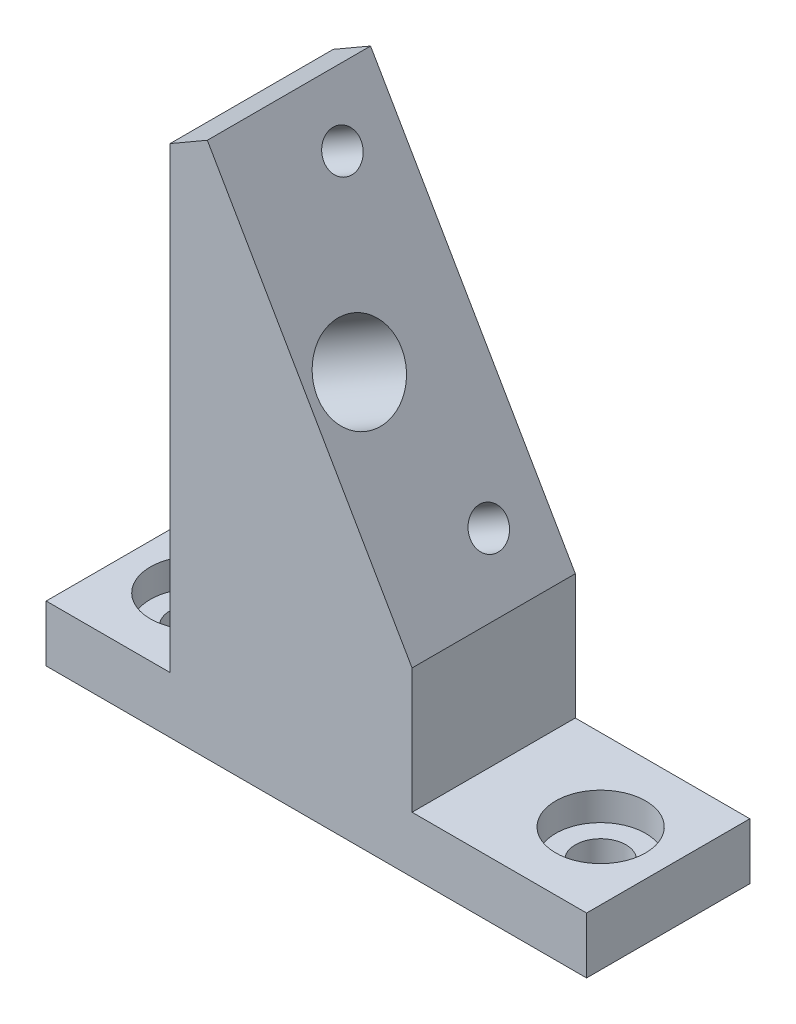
ISO-10303-21;
HEADER;
FILE_DESCRIPTION(('STEP AP214'),'2;1');
FILE_NAME('part.step','',(''),(''),'','','');
FILE_SCHEMA(('AUTOMOTIVE_DESIGN { 1 0 10303 214 1 1 1 1 }'));
ENDSEC;
DATA;
#1=APPLICATION_CONTEXT('core data for automotive mechanical design processes');
#2=APPLICATION_PROTOCOL_DEFINITION('international standard','automotive_design',2000,#1);
#3=PRODUCT_CONTEXT('',#1,'mechanical');
#4=PRODUCT('Part','Part','',(#3));
#5=PRODUCT_RELATED_PRODUCT_CATEGORY('part','',(#4));
#6=PRODUCT_DEFINITION_FORMATION('','',#4);
#7=PRODUCT_DEFINITION_CONTEXT('part definition',#1,'design');
#8=PRODUCT_DEFINITION('design','',#6,#7);
#9=PRODUCT_DEFINITION_SHAPE('','',#8);
#10=(LENGTH_UNIT() NAMED_UNIT(*) SI_UNIT(.MILLI.,.METRE.));
#11=(NAMED_UNIT(*) PLANE_ANGLE_UNIT() SI_UNIT($,.RADIAN.));
#12=(NAMED_UNIT(*) SI_UNIT($,.STERADIAN.) SOLID_ANGLE_UNIT());
#13=UNCERTAINTY_MEASURE_WITH_UNIT(LENGTH_MEASURE(1.E-05),#10,'distance_accuracy_value','');
#14=(GEOMETRIC_REPRESENTATION_CONTEXT(3) GLOBAL_UNCERTAINTY_ASSIGNED_CONTEXT((#13)) GLOBAL_UNIT_ASSIGNED_CONTEXT((#10,
#11,#12)) REPRESENTATION_CONTEXT('',''));
#15=CARTESIAN_POINT('',(0.,0.,0.));
#16=DIRECTION('',(0.,0.,1.));
#17=DIRECTION('',(1.,0.,0.));
#18=AXIS2_PLACEMENT_3D('',#15,#16,#17);
#19=CARTESIAN_POINT('',(42.,2.5,7.25));
#20=DIRECTION('',(0.,-1.,0.));
#21=DIRECTION('',(1.,0.,0.));
#22=AXIS2_PLACEMENT_3D('',#19,#20,#21);
#23=PLANE('',#22);
#24=CARTESIAN_POINT('',(42.,2.5,7.25));
#25=DIRECTION('',(0.,-1.,0.));
#26=DIRECTION('',(1.,0.,0.));
#27=AXIS2_PLACEMENT_3D('',#24,#25,#26);
#28=CIRCLE('',#27,4.);
#29=CARTESIAN_POINT('',(46.,2.5,7.25));
#30=VERTEX_POINT('',#29);
#31=EDGE_CURVE('E99',#30,#30,#28,.F.);
#32=ORIENTED_EDGE('',*,*,#31,.T.);
#33=EDGE_LOOP('',(#32));
#34=FACE_BOUND('',#33,.T.);
#35=CARTESIAN_POINT('',(42.,2.5,7.25));
#36=DIRECTION('',(0.,1.,0.));
#37=DIRECTION('',(-1.,0.,0.));
#38=AXIS2_PLACEMENT_3D('',#35,#36,#37);
#39=CIRCLE('',#38,2.25);
#40=CARTESIAN_POINT('',(39.75,2.5,7.25));
#41=VERTEX_POINT('',#40);
#42=EDGE_CURVE('E19',#41,#41,#39,.F.);
#43=ORIENTED_EDGE('',*,*,#42,.T.);
#44=EDGE_LOOP('',(#43));
#45=FACE_BOUND('',#44,.T.);
#46=ADVANCED_FACE('F16',(#34,#45),#23,.F.);
#47=CARTESIAN_POINT('',(19.4211616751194,14.7532124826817,5.));
#48=DIRECTION('',(0.86602540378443,0.500000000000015,0.));
#49=DIRECTION('',(-0.500000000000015,0.86602540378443,0.));
#50=AXIS2_PLACEMENT_3D('',#47,#48,#49);
#51=CONICAL_SURFACE('',#50,1.65000000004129,1.02974425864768);
#52=CARTESIAN_POINT('',(18.5625667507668,14.2575024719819,5.));
#53=VERTEX_POINT('',#52);
#54=VERTEX_LOOP('',#53);
#55=FACE_BOUND('',#54,.T.);
#56=CARTESIAN_POINT('',(19.4211616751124,14.75321248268,5.));
#57=DIRECTION('',(0.866025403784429,0.500000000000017,0.));
#58=DIRECTION('',(-0.500000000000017,0.866025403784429,0.));
#59=AXIS2_PLACEMENT_3D('',#56,#57,#58);
#60=CIRCLE('',#59,1.65);
#61=CARTESIAN_POINT('',(18.5961616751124,16.1821543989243,5.));
#62=VERTEX_POINT('',#61);
#63=EDGE_CURVE('E96',#62,#62,#60,.T.);
#64=ORIENTED_EDGE('',*,*,#63,.T.);
#65=EDGE_LOOP('',(#64));
#66=FACE_BOUND('',#65,.T.);
#67=ADVANCED_FACE('F90',(#55,#66),#51,.F.);
#68=CARTESIAN_POINT('',(6.00000000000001,2.5,7.25));
#69=DIRECTION('',(0.,-1.,0.));
#70=DIRECTION('',(1.,0.,0.));
#71=AXIS2_PLACEMENT_3D('',#68,#69,#70);
#72=PLANE('',#71);
#73=CARTESIAN_POINT('',(6.00000000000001,2.5,7.25));
#74=DIRECTION('',(0.,-1.,0.));
#75=DIRECTION('',(1.,0.,0.));
#76=AXIS2_PLACEMENT_3D('',#73,#74,#75);
#77=CIRCLE('',#76,4.);
#78=CARTESIAN_POINT('',(10.,2.5,7.25));
#79=VERTEX_POINT('',#78);
#80=EDGE_CURVE('E98',#79,#79,#77,.F.);
#81=ORIENTED_EDGE('',*,*,#80,.T.);
#82=EDGE_LOOP('',(#81));
#83=FACE_BOUND('',#82,.T.);
#84=CARTESIAN_POINT('',(6.00000000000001,2.5,7.25));
#85=DIRECTION('',(0.,1.,0.));
#86=DIRECTION('',(-1.,0.,0.));
#87=AXIS2_PLACEMENT_3D('',#84,#85,#86);
#88=CIRCLE('',#87,2.25);
#89=CARTESIAN_POINT('',(3.75,2.5,7.25));
#90=VERTEX_POINT('',#89);
#91=EDGE_CURVE('E104',#90,#90,#88,.F.);
#92=ORIENTED_EDGE('',*,*,#91,.T.);
#93=EDGE_LOOP('',(#92));
#94=FACE_BOUND('',#93,.T.);
#95=ADVANCED_FACE('F93',(#83,#94),#72,.F.);
#96=CARTESIAN_POINT('',(42.,0.,7.25));
#97=DIRECTION('',(0.,1.,0.));
#98=DIRECTION('',(-1.,0.,0.));
#99=AXIS2_PLACEMENT_3D('',#96,#97,#98);
#100=CYLINDRICAL_SURFACE('',#99,2.25);
#101=ORIENTED_EDGE('',*,*,#42,.F.);
#102=EDGE_LOOP('',(#101));
#103=FACE_BOUND('',#102,.T.);
#104=CARTESIAN_POINT('',(42.,0.,7.25));
#105=DIRECTION('',(0.,1.,0.));
#106=DIRECTION('',(-1.,0.,0.));
#107=AXIS2_PLACEMENT_3D('',#104,#105,#106);
#108=CIRCLE('',#107,2.25);
#109=CARTESIAN_POINT('',(39.75,0.,7.25));
#110=VERTEX_POINT('',#109);
#111=EDGE_CURVE('E141',#110,#110,#108,.T.);
#112=ORIENTED_EDGE('',*,*,#111,.F.);
#113=EDGE_LOOP('',(#112));
#114=FACE_BOUND('',#113,.T.);
#115=ADVANCED_FACE('F150',(#103,#114),#100,.F.);
#116=CARTESIAN_POINT('',(6.00000000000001,0.,7.25));
#117=DIRECTION('',(0.,1.,0.));
#118=DIRECTION('',(-1.,0.,0.));
#119=AXIS2_PLACEMENT_3D('',#116,#117,#118);
#120=CYLINDRICAL_SURFACE('',#119,2.25);
#121=ORIENTED_EDGE('',*,*,#91,.F.);
#122=EDGE_LOOP('',(#121));
#123=FACE_BOUND('',#122,.T.);
#124=CARTESIAN_POINT('',(6.00000000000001,0.,7.25));
#125=DIRECTION('',(0.,1.,0.));
#126=DIRECTION('',(-1.,0.,0.));
#127=AXIS2_PLACEMENT_3D('',#124,#125,#126);
#128=CIRCLE('',#127,2.25);
#129=CARTESIAN_POINT('',(3.75,0.,7.25));
#130=VERTEX_POINT('',#129);
#131=EDGE_CURVE('E137',#130,#130,#128,.T.);
#132=ORIENTED_EDGE('',*,*,#131,.F.);
#133=EDGE_LOOP('',(#132));
#134=FACE_BOUND('',#133,.T.);
#135=ADVANCED_FACE('F153',(#123,#134),#120,.F.);
#136=CARTESIAN_POINT('',(42.,5.,7.25));
#137=DIRECTION('',(0.,-1.,0.));
#138=DIRECTION('',(1.,0.,0.));
#139=AXIS2_PLACEMENT_3D('',#136,#137,#138);
#140=CYLINDRICAL_SURFACE('',#139,4.);
#141=ORIENTED_EDGE('',*,*,#31,.F.);
#142=EDGE_LOOP('',(#141));
#143=FACE_BOUND('',#142,.T.);
#144=CARTESIAN_POINT('',(42.,5.,7.25));
#145=DIRECTION('',(0.,-1.,0.));
#146=DIRECTION('',(1.,0.,0.));
#147=AXIS2_PLACEMENT_3D('',#144,#145,#146);
#148=CIRCLE('',#147,4.);
#149=CARTESIAN_POINT('',(46.,5.,7.25));
#150=VERTEX_POINT('',#149);
#151=EDGE_CURVE('E132',#150,#150,#148,.T.);
#152=ORIENTED_EDGE('',*,*,#151,.F.);
#153=EDGE_LOOP('',(#152));
#154=FACE_BOUND('',#153,.T.);
#155=ADVANCED_FACE('F214',(#143,#154),#140,.F.);
#156=CARTESIAN_POINT('',(18.00002176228,13.93271697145,5.));
#157=DIRECTION('',(0.866025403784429,0.500000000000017,0.));
#158=DIRECTION('',(-0.500000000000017,0.866025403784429,0.));
#159=AXIS2_PLACEMENT_3D('',#156,#157,#158);
#160=CYLINDRICAL_SURFACE('',#159,1.65);
#161=ORIENTED_EDGE('',*,*,#63,.F.);
#162=EDGE_LOOP('',(#161));
#163=FACE_BOUND('',#162,.T.);
#164=CARTESIAN_POINT('',(29.8134665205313,20.7532124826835,5.));
#165=DIRECTION('',(0.866025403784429,0.500000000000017,0.));
#166=DIRECTION('',(-0.500000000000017,0.866025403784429,0.));
#167=AXIS2_PLACEMENT_3D('',#164,#165,#166);
#168=CIRCLE('',#167,1.65);
#169=CARTESIAN_POINT('',(28.9884665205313,22.1821543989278,5.));
#170=VERTEX_POINT('',#169);
#171=EDGE_CURVE('E125',#170,#170,#168,.F.);
#172=ORIENTED_EDGE('',*,*,#171,.F.);
#173=EDGE_LOOP('',(#172));
#174=FACE_BOUND('',#173,.T.);
#175=ADVANCED_FACE('F216',(#163,#174),#160,.F.);
#176=CARTESIAN_POINT('',(23.31346652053,32.01154273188,10.));
#177=DIRECTION('',(0.866025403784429,0.500000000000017,0.));
#178=DIRECTION('',(-0.500000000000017,0.866025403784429,0.));
#179=AXIS2_PLACEMENT_3D('',#176,#177,#178);
#180=CYLINDRICAL_SURFACE('',#179,3.75);
#181=CARTESIAN_POINT('',(23.3134665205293,32.0115427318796,10.));
#182=DIRECTION('',(0.866025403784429,0.500000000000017,0.));
#183=DIRECTION('',(-0.500000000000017,0.866025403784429,0.));
#184=AXIS2_PLACEMENT_3D('',#181,#182,#183);
#185=CIRCLE('',#184,3.75);
#186=CARTESIAN_POINT('',(21.4384665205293,35.2591379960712,10.));
#187=VERTEX_POINT('',#186);
#188=EDGE_CURVE('E128',#187,#187,#185,.F.);
#189=ORIENTED_EDGE('',*,*,#188,.F.);
#190=EDGE_LOOP('',(#189));
#191=FACE_BOUND('',#190,.T.);
#192=CARTESIAN_POINT('',(11.,24.9023595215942,10.));
#193=DIRECTION('',(-1.,0.,0.));
#194=DIRECTION('',(0.,1.,0.));
#195=AXIS2_PLACEMENT_3D('',#192,#193,#194);
#196=ELLIPSE('',#195,4.33012701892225,3.75);
#197=CARTESIAN_POINT('',(11.,29.2324865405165,10.));
#198=VERTEX_POINT('',#197);
#199=EDGE_CURVE('E117',#198,#198,#196,.F.);
#200=ORIENTED_EDGE('',*,*,#199,.F.);
#201=EDGE_LOOP('',(#200));
#202=FACE_BOUND('',#201,.T.);
#203=ADVANCED_FACE('F223',(#191,#202),#180,.F.);
#204=CARTESIAN_POINT('',(5.00002176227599,36.44937746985,5.));
#205=DIRECTION('',(0.866025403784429,0.500000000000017,0.));
#206=DIRECTION('',(-0.500000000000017,0.866025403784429,0.));
#207=AXIS2_PLACEMENT_3D('',#204,#205,#206);
#208=CYLINDRICAL_SURFACE('',#207,1.65);
#209=CARTESIAN_POINT('',(16.813466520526,43.2698729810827,5.));
#210=DIRECTION('',(0.866025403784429,0.500000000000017,0.));
#211=DIRECTION('',(-0.500000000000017,0.866025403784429,0.));
#212=AXIS2_PLACEMENT_3D('',#209,#210,#211);
#213=CIRCLE('',#212,1.65);
#214=CARTESIAN_POINT('',(15.9884665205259,44.698814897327,5.));
#215=VERTEX_POINT('',#214);
#216=EDGE_CURVE('E121',#215,#215,#213,.F.);
#217=ORIENTED_EDGE('',*,*,#216,.F.);
#218=EDGE_LOOP('',(#217));
#219=FACE_BOUND('',#218,.T.);
#220=CARTESIAN_POINT('',(11.,39.913466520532,5.));
#221=DIRECTION('',(-1.,0.,0.));
#222=DIRECTION('',(0.,1.,0.));
#223=AXIS2_PLACEMENT_3D('',#220,#221,#222);
#224=ELLIPSE('',#223,1.90525588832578,1.65);
#225=CARTESIAN_POINT('',(11.,41.8187224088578,5.));
#226=VERTEX_POINT('',#225);
#227=EDGE_CURVE('E113',#226,#226,#224,.F.);
#228=ORIENTED_EDGE('',*,*,#227,.F.);
#229=EDGE_LOOP('',(#228));
#230=FACE_BOUND('',#229,.T.);
#231=ADVANCED_FACE('F239',(#219,#230),#208,.F.);
#232=CARTESIAN_POINT('',(6.00000000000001,5.,7.25));
#233=DIRECTION('',(0.,-1.,0.));
#234=DIRECTION('',(1.,0.,0.));
#235=AXIS2_PLACEMENT_3D('',#232,#233,#234);
#236=CYLINDRICAL_SURFACE('',#235,4.);
#237=ORIENTED_EDGE('',*,*,#80,.F.);
#238=EDGE_LOOP('',(#237));
#239=FACE_BOUND('',#238,.T.);
#240=CARTESIAN_POINT('',(6.00000000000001,5.,7.25));
#241=DIRECTION('',(0.,-1.,0.));
#242=DIRECTION('',(1.,0.,0.));
#243=AXIS2_PLACEMENT_3D('',#240,#241,#242);
#244=CIRCLE('',#243,4.);
#245=CARTESIAN_POINT('',(10.,5.,7.25));
#246=VERTEX_POINT('',#245);
#247=EDGE_CURVE('E109',#246,#246,#244,.T.);
#248=ORIENTED_EDGE('',*,*,#247,.F.);
#249=EDGE_LOOP('',(#248));
#250=FACE_BOUND('',#249,.T.);
#251=ADVANCED_FACE('F236',(#239,#250),#236,.F.);
#252=CARTESIAN_POINT('',(0.,0.,14.5));
#253=DIRECTION('',(0.,0.,1.));
#254=DIRECTION('',(1.,0.,0.));
#255=AXIS2_PLACEMENT_3D('',#252,#253,#254);
#256=PLANE('',#255);
#257=DIRECTION('',(0.,1.,0.));
#258=VECTOR('',#257,1.);
#259=CARTESIAN_POINT('',(11.,45.68696921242,14.5));
#260=LINE('',#259,#258);
#261=CARTESIAN_POINT('',(11.,5.,14.5));
#262=VERTEX_POINT('',#261);
#263=CARTESIAN_POINT('',(10.9999999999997,45.6869692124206,14.5));
#264=VERTEX_POINT('',#263);
#265=EDGE_CURVE('E112',#262,#264,#260,.T.);
#266=ORIENTED_EDGE('',*,*,#265,.F.);
#267=DIRECTION('',(-1.,0.,0.));
#268=VECTOR('',#267,1.);
#269=CARTESIAN_POINT('',(11.,5.,14.5));
#270=LINE('',#269,#268);
#271=CARTESIAN_POINT('',(0.,5.,14.5));
#272=VERTEX_POINT('',#271);
#273=EDGE_CURVE('E394',#272,#262,#270,.F.);
#274=ORIENTED_EDGE('',*,*,#273,.F.);
#275=DIRECTION('',(0.,1.,0.));
#276=VECTOR('',#275,1.);
#277=CARTESIAN_POINT('',(0.,5.,14.5));
#278=LINE('',#277,#276);
#279=CARTESIAN_POINT('',(0.,0.,14.5));
#280=VERTEX_POINT('',#279);
#281=EDGE_CURVE('E86',#280,#272,#278,.T.);
#282=ORIENTED_EDGE('',*,*,#281,.F.);
#283=DIRECTION('',(1.,0.,0.));
#284=VECTOR('',#283,1.);
#285=CARTESIAN_POINT('',(0.,0.,14.5));
#286=LINE('',#285,#284);
#287=CARTESIAN_POINT('',(48.,0.,14.5));
#288=VERTEX_POINT('',#287);
#289=EDGE_CURVE('E425',#288,#280,#286,.F.);
#290=ORIENTED_EDGE('',*,*,#289,.F.);
#291=DIRECTION('',(0.,1.,0.));
#292=VECTOR('',#291,1.);
#293=CARTESIAN_POINT('',(48.,0.,14.5));
#294=LINE('',#293,#292);
#295=CARTESIAN_POINT('',(48.,5.,14.5));
#296=VERTEX_POINT('',#295);
#297=EDGE_CURVE('E136',#296,#288,#294,.F.);
#298=ORIENTED_EDGE('',*,*,#297,.F.);
#299=DIRECTION('',(-1.,0.,0.));
#300=VECTOR('',#299,1.);
#301=CARTESIAN_POINT('',(48.,5.,14.5));
#302=LINE('',#301,#300);
#303=CARTESIAN_POINT('',(32.5,5.,14.5));
#304=VERTEX_POINT('',#303);
#305=EDGE_CURVE('E418',#304,#296,#302,.F.);
#306=ORIENTED_EDGE('',*,*,#305,.F.);
#307=DIRECTION('',(0.,1.,0.));
#308=VECTOR('',#307,1.);
#309=CARTESIAN_POINT('',(32.5,5.,14.5));
#310=LINE('',#309,#308);
#311=CARTESIAN_POINT('',(32.5,16.1,14.5));
#312=VERTEX_POINT('',#311);
#313=EDGE_CURVE('E131',#312,#304,#310,.F.);
#314=ORIENTED_EDGE('',*,*,#313,.F.);
#315=DIRECTION('',(-0.500000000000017,0.866025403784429,0.));
#316=VECTOR('',#315,1.);
#317=CARTESIAN_POINT('',(32.5,16.1,14.5));
#318=LINE('',#317,#316);
#319=CARTESIAN_POINT('',(14.3134665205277,47.5999999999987,14.5));
#320=VERTEX_POINT('',#319);
#321=EDGE_CURVE('E411',#320,#312,#318,.F.);
#322=ORIENTED_EDGE('',*,*,#321,.F.);
#323=DIRECTION('',(-0.866025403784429,-0.500000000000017,0.));
#324=VECTOR('',#323,1.);
#325=CARTESIAN_POINT('',(14.31346652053,47.6,14.5));
#326=LINE('',#325,#324);
#327=EDGE_CURVE('E120',#264,#320,#326,.F.);
#328=ORIENTED_EDGE('',*,*,#327,.F.);
#329=EDGE_LOOP('',(#266,#274,#282,#290,#298,#306,#314,#322,#328));
#330=FACE_BOUND('',#329,.T.);
#331=ADVANCED_FACE('F171',(#330),#256,.T.);
#332=CARTESIAN_POINT('',(0.,5.,0.));
#333=DIRECTION('',(-1.,0.,0.));
#334=DIRECTION('',(0.,0.,1.));
#335=AXIS2_PLACEMENT_3D('',#332,#333,#334);
#336=PLANE('',#335);
#337=DIRECTION('',(0.,0.,1.));
#338=VECTOR('',#337,1.);
#339=CARTESIAN_POINT('',(0.,0.,0.));
#340=LINE('',#339,#338);
#341=CARTESIAN_POINT('',(0.,0.,0.));
#342=VERTEX_POINT('',#341);
#343=EDGE_CURVE('E140',#280,#342,#340,.F.);
#344=ORIENTED_EDGE('',*,*,#343,.F.);
#345=ORIENTED_EDGE('',*,*,#281,.T.);
#346=DIRECTION('',(0.,0.,1.));
#347=VECTOR('',#346,1.);
#348=CARTESIAN_POINT('',(0.,5.,0.));
#349=LINE('',#348,#347);
#350=CARTESIAN_POINT('',(0.,5.,0.));
#351=VERTEX_POINT('',#350);
#352=EDGE_CURVE('E400',#351,#272,#349,.T.);
#353=ORIENTED_EDGE('',*,*,#352,.F.);
#354=DIRECTION('',(0.,1.,0.));
#355=VECTOR('',#354,1.);
#356=CARTESIAN_POINT('',(0.,0.,0.));
#357=LINE('',#356,#355);
#358=EDGE_CURVE('E401',#351,#342,#357,.F.);
#359=ORIENTED_EDGE('',*,*,#358,.T.);
#360=EDGE_LOOP('',(#344,#345,#353,#359));
#361=FACE_BOUND('',#360,.T.);
#362=ADVANCED_FACE('F160',(#361),#336,.T.);
#363=CARTESIAN_POINT('',(0.,0.,0.));
#364=DIRECTION('',(0.,-1.,0.));
#365=DIRECTION('',(1.,0.,0.));
#366=AXIS2_PLACEMENT_3D('',#363,#364,#365);
#367=PLANE('',#366);
#368=DIRECTION('',(0.,0.,-1.));
#369=VECTOR('',#368,1.);
#370=CARTESIAN_POINT('',(48.,0.,0.));
#371=LINE('',#370,#369);
#372=CARTESIAN_POINT('',(48.,0.,0.));
#373=VERTEX_POINT('',#372);
#374=EDGE_CURVE('E423',#288,#373,#371,.T.);
#375=ORIENTED_EDGE('',*,*,#374,.F.);
#376=ORIENTED_EDGE('',*,*,#289,.T.);
#377=ORIENTED_EDGE('',*,*,#343,.T.);
#378=DIRECTION('',(1.,0.,0.));
#379=VECTOR('',#378,1.);
#380=CARTESIAN_POINT('',(0.,0.,0.));
#381=LINE('',#380,#379);
#382=EDGE_CURVE('E429',#342,#373,#381,.T.);
#383=ORIENTED_EDGE('',*,*,#382,.T.);
#384=EDGE_LOOP('',(#375,#376,#377,#383));
#385=FACE_BOUND('',#384,.T.);
#386=ORIENTED_EDGE('',*,*,#131,.T.);
#387=EDGE_LOOP('',(#386));
#388=FACE_BOUND('',#387,.T.);
#389=ORIENTED_EDGE('',*,*,#111,.T.);
#390=EDGE_LOOP('',(#389));
#391=FACE_BOUND('',#390,.T.);
#392=ADVANCED_FACE('F157',(#385,#388,#391),#367,.T.);
#393=CARTESIAN_POINT('',(48.,0.,0.));
#394=DIRECTION('',(1.,0.,0.));
#395=DIRECTION('',(0.,0.,-1.));
#396=AXIS2_PLACEMENT_3D('',#393,#394,#395);
#397=PLANE('',#396);
#398=DIRECTION('',(0.,0.,1.));
#399=VECTOR('',#398,1.);
#400=CARTESIAN_POINT('',(48.,5.,0.));
#401=LINE('',#400,#399);
#402=CARTESIAN_POINT('',(48.,5.,0.));
#403=VERTEX_POINT('',#402);
#404=EDGE_CURVE('E135',#296,#403,#401,.F.);
#405=ORIENTED_EDGE('',*,*,#404,.F.);
#406=ORIENTED_EDGE('',*,*,#297,.T.);
#407=ORIENTED_EDGE('',*,*,#374,.T.);
#408=DIRECTION('',(0.,1.,0.));
#409=VECTOR('',#408,1.);
#410=CARTESIAN_POINT('',(48.,0.,0.));
#411=LINE('',#410,#409);
#412=EDGE_CURVE('E434',#373,#403,#411,.T.);
#413=ORIENTED_EDGE('',*,*,#412,.T.);
#414=EDGE_LOOP('',(#405,#406,#407,#413));
#415=FACE_BOUND('',#414,.T.);
#416=ADVANCED_FACE('F159',(#415),#397,.T.);
#417=CARTESIAN_POINT('',(48.,5.,0.));
#418=DIRECTION('',(0.,1.,0.));
#419=DIRECTION('',(-1.,0.,0.));
#420=AXIS2_PLACEMENT_3D('',#417,#418,#419);
#421=PLANE('',#420);
#422=DIRECTION('',(0.,0.,-1.));
#423=VECTOR('',#422,1.);
#424=CARTESIAN_POINT('',(32.5,5.,0.));
#425=LINE('',#424,#423);
#426=CARTESIAN_POINT('',(32.5,5.,0.));
#427=VERTEX_POINT('',#426);
#428=EDGE_CURVE('E211',#304,#427,#425,.T.);
#429=ORIENTED_EDGE('',*,*,#428,.F.);
#430=ORIENTED_EDGE('',*,*,#305,.T.);
#431=ORIENTED_EDGE('',*,*,#404,.T.);
#432=DIRECTION('',(1.,0.,0.));
#433=VECTOR('',#432,1.);
#434=CARTESIAN_POINT('',(0.,5.,0.));
#435=LINE('',#434,#433);
#436=EDGE_CURVE('E439',#403,#427,#435,.F.);
#437=ORIENTED_EDGE('',*,*,#436,.T.);
#438=EDGE_LOOP('',(#429,#430,#431,#437));
#439=FACE_BOUND('',#438,.T.);
#440=ORIENTED_EDGE('',*,*,#151,.T.);
#441=EDGE_LOOP('',(#440));
#442=FACE_BOUND('',#441,.T.);
#443=ADVANCED_FACE('F168',(#439,#442),#421,.T.);
#444=CARTESIAN_POINT('',(32.5,5.,0.));
#445=DIRECTION('',(1.,0.,0.));
#446=DIRECTION('',(0.,0.,-1.));
#447=AXIS2_PLACEMENT_3D('',#444,#445,#446);
#448=PLANE('',#447);
#449=DIRECTION('',(0.,0.,1.));
#450=VECTOR('',#449,1.);
#451=CARTESIAN_POINT('',(32.5,16.1,0.));
#452=LINE('',#451,#450);
#453=CARTESIAN_POINT('',(32.5,16.1,0.));
#454=VERTEX_POINT('',#453);
#455=EDGE_CURVE('E124',#312,#454,#452,.F.);
#456=ORIENTED_EDGE('',*,*,#455,.F.);
#457=ORIENTED_EDGE('',*,*,#313,.T.);
#458=ORIENTED_EDGE('',*,*,#428,.T.);
#459=DIRECTION('',(0.,1.,0.));
#460=VECTOR('',#459,1.);
#461=CARTESIAN_POINT('',(32.5,0.,0.));
#462=LINE('',#461,#460);
#463=EDGE_CURVE('E441',#427,#454,#462,.T.);
#464=ORIENTED_EDGE('',*,*,#463,.T.);
#465=EDGE_LOOP('',(#456,#457,#458,#464));
#466=FACE_BOUND('',#465,.T.);
#467=ADVANCED_FACE('F198',(#466),#448,.T.);
#468=CARTESIAN_POINT('',(32.5,16.1,0.));
#469=DIRECTION('',(0.866025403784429,0.500000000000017,0.));
#470=DIRECTION('',(-0.500000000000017,0.866025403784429,0.));
#471=AXIS2_PLACEMENT_3D('',#468,#469,#470);
#472=PLANE('',#471);
#473=DIRECTION('',(0.,0.,1.));
#474=VECTOR('',#473,1.);
#475=CARTESIAN_POINT('',(14.3134665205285,47.5999999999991,0.));
#476=LINE('',#475,#474);
#477=CARTESIAN_POINT('',(14.3134665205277,47.5999999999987,0.));
#478=VERTEX_POINT('',#477);
#479=EDGE_CURVE('E409',#320,#478,#476,.F.);
#480=ORIENTED_EDGE('',*,*,#479,.F.);
#481=ORIENTED_EDGE('',*,*,#321,.T.);
#482=ORIENTED_EDGE('',*,*,#455,.T.);
#483=DIRECTION('',(-0.499999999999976,0.866025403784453,0.));
#484=VECTOR('',#483,1.);
#485=CARTESIAN_POINT('',(32.5,16.1,0.));
#486=LINE('',#485,#484);
#487=EDGE_CURVE('E444',#454,#478,#486,.T.);
#488=ORIENTED_EDGE('',*,*,#487,.T.);
#489=EDGE_LOOP('',(#480,#481,#482,#488));
#490=FACE_BOUND('',#489,.T.);
#491=ORIENTED_EDGE('',*,*,#216,.T.);
#492=EDGE_LOOP('',(#491));
#493=FACE_BOUND('',#492,.T.);
#494=ORIENTED_EDGE('',*,*,#171,.T.);
#495=EDGE_LOOP('',(#494));
#496=FACE_BOUND('',#495,.T.);
#497=ORIENTED_EDGE('',*,*,#188,.T.);
#498=EDGE_LOOP('',(#497));
#499=FACE_BOUND('',#498,.T.);
#500=ADVANCED_FACE('F194',(#490,#493,#496,#499),#472,.T.);
#501=CARTESIAN_POINT('',(14.31346652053,47.6,0.));
#502=DIRECTION('',(-0.500000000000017,0.866025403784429,0.));
#503=DIRECTION('',(-0.866025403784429,-0.500000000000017,0.));
#504=AXIS2_PLACEMENT_3D('',#501,#502,#503);
#505=PLANE('',#504);
#506=DIRECTION('',(0.,0.,1.));
#507=VECTOR('',#506,1.);
#508=CARTESIAN_POINT('',(11.,45.6869692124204,0.));
#509=LINE('',#508,#507);
#510=CARTESIAN_POINT('',(10.9999999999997,45.6869692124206,0.));
#511=VERTEX_POINT('',#510);
#512=EDGE_CURVE('E116',#264,#511,#509,.F.);
#513=ORIENTED_EDGE('',*,*,#512,.F.);
#514=ORIENTED_EDGE('',*,*,#327,.T.);
#515=ORIENTED_EDGE('',*,*,#479,.T.);
#516=DIRECTION('',(-0.866025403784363,-0.500000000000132,0.));
#517=VECTOR('',#516,1.);
#518=CARTESIAN_POINT('',(14.3134665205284,47.5999999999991,0.));
#519=LINE('',#518,#517);
#520=EDGE_CURVE('E447',#478,#511,#519,.T.);
#521=ORIENTED_EDGE('',*,*,#520,.T.);
#522=EDGE_LOOP('',(#513,#514,#515,#521));
#523=FACE_BOUND('',#522,.T.);
#524=ADVANCED_FACE('F190',(#523),#505,.T.);
#525=CARTESIAN_POINT('',(11.,45.68696921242,0.));
#526=DIRECTION('',(-1.,0.,0.));
#527=DIRECTION('',(0.,0.,1.));
#528=AXIS2_PLACEMENT_3D('',#525,#526,#527);
#529=PLANE('',#528);
#530=DIRECTION('',(0.,0.,1.));
#531=VECTOR('',#530,1.);
#532=CARTESIAN_POINT('',(11.,5.,0.));
#533=LINE('',#532,#531);
#534=CARTESIAN_POINT('',(11.,5.,0.));
#535=VERTEX_POINT('',#534);
#536=EDGE_CURVE('E33',#262,#535,#533,.F.);
#537=ORIENTED_EDGE('',*,*,#536,.F.);
#538=ORIENTED_EDGE('',*,*,#265,.T.);
#539=ORIENTED_EDGE('',*,*,#512,.T.);
#540=DIRECTION('',(0.,1.,0.));
#541=VECTOR('',#540,1.);
#542=CARTESIAN_POINT('',(10.9999999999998,0.,0.));
#543=LINE('',#542,#541);
#544=EDGE_CURVE('E25',#511,#535,#543,.F.);
#545=ORIENTED_EDGE('',*,*,#544,.T.);
#546=EDGE_LOOP('',(#537,#538,#539,#545));
#547=FACE_BOUND('',#546,.T.);
#548=ORIENTED_EDGE('',*,*,#227,.T.);
#549=EDGE_LOOP('',(#548));
#550=FACE_BOUND('',#549,.T.);
#551=ORIENTED_EDGE('',*,*,#199,.T.);
#552=EDGE_LOOP('',(#551));
#553=FACE_BOUND('',#552,.T.);
#554=ADVANCED_FACE('F184',(#547,#550,#553),#529,.T.);
#555=CARTESIAN_POINT('',(11.,5.,0.));
#556=DIRECTION('',(0.,1.,0.));
#557=DIRECTION('',(-1.,0.,0.));
#558=AXIS2_PLACEMENT_3D('',#555,#556,#557);
#559=PLANE('',#558);
#560=ORIENTED_EDGE('',*,*,#352,.T.);
#561=ORIENTED_EDGE('',*,*,#273,.T.);
#562=ORIENTED_EDGE('',*,*,#536,.T.);
#563=DIRECTION('',(1.,0.,0.));
#564=VECTOR('',#563,1.);
#565=CARTESIAN_POINT('',(0.,5.,0.));
#566=LINE('',#565,#564);
#567=EDGE_CURVE('E11',#535,#351,#566,.F.);
#568=ORIENTED_EDGE('',*,*,#567,.T.);
#569=EDGE_LOOP('',(#560,#561,#562,#568));
#570=FACE_BOUND('',#569,.T.);
#571=ORIENTED_EDGE('',*,*,#247,.T.);
#572=EDGE_LOOP('',(#571));
#573=FACE_BOUND('',#572,.T.);
#574=ADVANCED_FACE('F178',(#570,#573),#559,.T.);
#575=CARTESIAN_POINT('',(0.,0.,0.));
#576=DIRECTION('',(0.,0.,1.));
#577=DIRECTION('',(1.,0.,0.));
#578=AXIS2_PLACEMENT_3D('',#575,#576,#577);
#579=PLANE('',#578);
#580=ORIENTED_EDGE('',*,*,#544,.F.);
#581=ORIENTED_EDGE('',*,*,#520,.F.);
#582=ORIENTED_EDGE('',*,*,#487,.F.);
#583=ORIENTED_EDGE('',*,*,#463,.F.);
#584=ORIENTED_EDGE('',*,*,#436,.F.);
#585=ORIENTED_EDGE('',*,*,#412,.F.);
#586=ORIENTED_EDGE('',*,*,#382,.F.);
#587=ORIENTED_EDGE('',*,*,#358,.F.);
#588=ORIENTED_EDGE('',*,*,#567,.F.);
#589=EDGE_LOOP('',(#580,#581,#582,#583,#584,#585,#586,#587,#588));
#590=FACE_BOUND('',#589,.T.);
#591=ADVANCED_FACE('F176',(#590),#579,.F.);
#592=CLOSED_SHELL('',(#46,#67,#95,#115,#135,#155,#175,#203,#231,#251,#331,#362,#392,#416,#443,
#467,#500,#524,#554,#574,#591));
#593=MANIFOLD_SOLID_BREP('B1',#592);
#594=ADVANCED_BREP_SHAPE_REPRESENTATION('',(#18,#593),#14);
#595=SHAPE_DEFINITION_REPRESENTATION(#9,#594);
ENDSEC;
END-ISO-10303-21;
